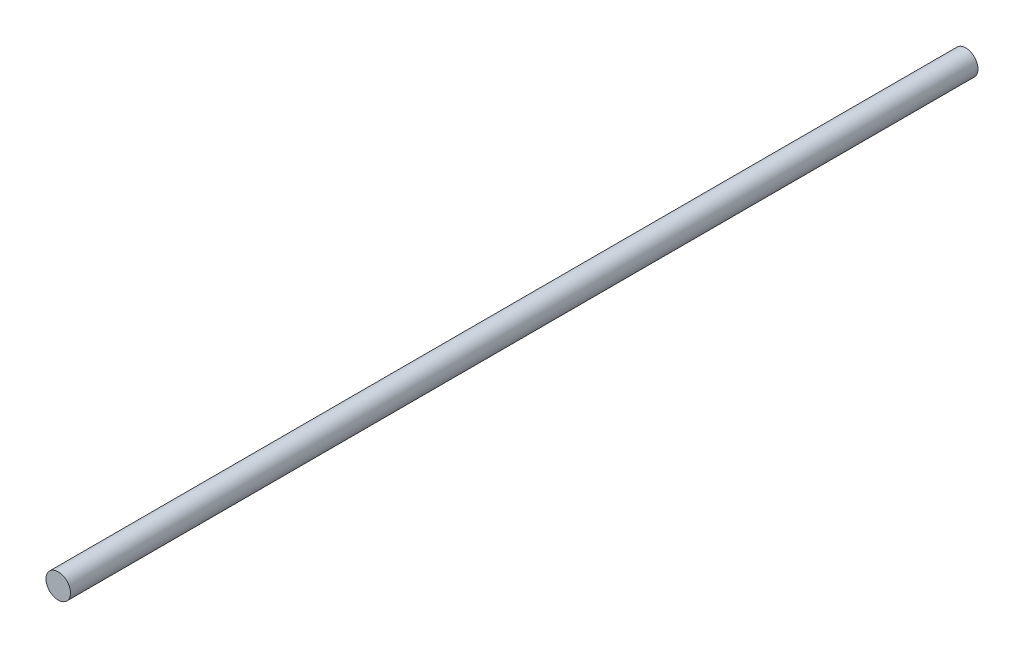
ISO-10303-21;
HEADER;
FILE_DESCRIPTION(('STEP AP214'),'2;1');
FILE_NAME('part.step','',(''),(''),'','','');
FILE_SCHEMA(('AUTOMOTIVE_DESIGN { 1 0 10303 214 1 1 1 1 }'));
ENDSEC;
DATA;
#1=APPLICATION_CONTEXT('core data for automotive mechanical design processes');
#2=APPLICATION_PROTOCOL_DEFINITION('international standard','automotive_design',2000,#1);
#3=PRODUCT_CONTEXT('',#1,'mechanical');
#4=PRODUCT('Part','Part','',(#3));
#5=PRODUCT_RELATED_PRODUCT_CATEGORY('part','',(#4));
#6=PRODUCT_DEFINITION_FORMATION('','',#4);
#7=PRODUCT_DEFINITION_CONTEXT('part definition',#1,'design');
#8=PRODUCT_DEFINITION('design','',#6,#7);
#9=PRODUCT_DEFINITION_SHAPE('','',#8);
#10=(LENGTH_UNIT() NAMED_UNIT(*) SI_UNIT(.MILLI.,.METRE.));
#11=(NAMED_UNIT(*) PLANE_ANGLE_UNIT() SI_UNIT($,.RADIAN.));
#12=(NAMED_UNIT(*) SI_UNIT($,.STERADIAN.) SOLID_ANGLE_UNIT());
#13=UNCERTAINTY_MEASURE_WITH_UNIT(LENGTH_MEASURE(1.E-05),#10,'distance_accuracy_value','');
#14=(GEOMETRIC_REPRESENTATION_CONTEXT(3) GLOBAL_UNCERTAINTY_ASSIGNED_CONTEXT((#13)) GLOBAL_UNIT_ASSIGNED_CONTEXT((#10,
#11,#12)) REPRESENTATION_CONTEXT('',''));
#15=CARTESIAN_POINT('',(0.,0.,0.));
#16=DIRECTION('',(0.,0.,1.));
#17=DIRECTION('',(1.,0.,0.));
#18=AXIS2_PLACEMENT_3D('',#15,#16,#17);
#19=CARTESIAN_POINT('',(0.,0.,370.));
#20=DIRECTION('',(0.,0.,-1.));
#21=DIRECTION('',(-1.,0.,0.));
#22=AXIS2_PLACEMENT_3D('',#19,#20,#21);
#23=CYLINDRICAL_SURFACE('',#22,5.);
#24=CARTESIAN_POINT('',(0.,0.,370.));
#25=DIRECTION('',(0.,0.,1.));
#26=DIRECTION('',(1.,0.,0.));
#27=AXIS2_PLACEMENT_3D('',#24,#25,#26);
#28=CIRCLE('',#27,5.);
#29=CARTESIAN_POINT('',(5.,0.,370.));
#30=VERTEX_POINT('',#29);
#31=EDGE_CURVE('E10',#30,#30,#28,.T.);
#32=ORIENTED_EDGE('',*,*,#31,.F.);
#33=EDGE_LOOP('',(#32));
#34=FACE_BOUND('',#33,.T.);
#35=CARTESIAN_POINT('',(0.,0.,0.));
#36=DIRECTION('',(0.,0.,1.));
#37=DIRECTION('',(1.,0.,0.));
#38=AXIS2_PLACEMENT_3D('',#35,#36,#37);
#39=CIRCLE('',#38,5.);
#40=CARTESIAN_POINT('',(5.,0.,0.));
#41=VERTEX_POINT('',#40);
#42=EDGE_CURVE('E45',#41,#41,#39,.T.);
#43=ORIENTED_EDGE('',*,*,#42,.T.);
#44=EDGE_LOOP('',(#43));
#45=FACE_BOUND('',#44,.T.);
#46=ADVANCED_FACE('F42',(#34,#45),#23,.T.);
#47=CARTESIAN_POINT('',(0.,0.,370.));
#48=DIRECTION('',(0.,0.,1.));
#49=DIRECTION('',(1.,0.,0.));
#50=AXIS2_PLACEMENT_3D('',#47,#48,#49);
#51=PLANE('',#50);
#52=ORIENTED_EDGE('',*,*,#31,.T.);
#53=EDGE_LOOP('',(#52));
#54=FACE_BOUND('',#53,.T.);
#55=ADVANCED_FACE('F61',(#54),#51,.T.);
#56=CARTESIAN_POINT('',(0.,0.,0.));
#57=DIRECTION('',(0.,0.,1.));
#58=DIRECTION('',(1.,0.,0.));
#59=AXIS2_PLACEMENT_3D('',#56,#57,#58);
#60=PLANE('',#59);
#61=ORIENTED_EDGE('',*,*,#42,.F.);
#62=EDGE_LOOP('',(#61));
#63=FACE_BOUND('',#62,.T.);
#64=ADVANCED_FACE('F59',(#63),#60,.F.);
#65=CLOSED_SHELL('',(#46,#55,#64));
#66=MANIFOLD_SOLID_BREP('B2',#65);
#67=ADVANCED_BREP_SHAPE_REPRESENTATION('',(#18,#66),#14);
#68=SHAPE_DEFINITION_REPRESENTATION(#9,#67);
ENDSEC;
END-ISO-10303-21;
